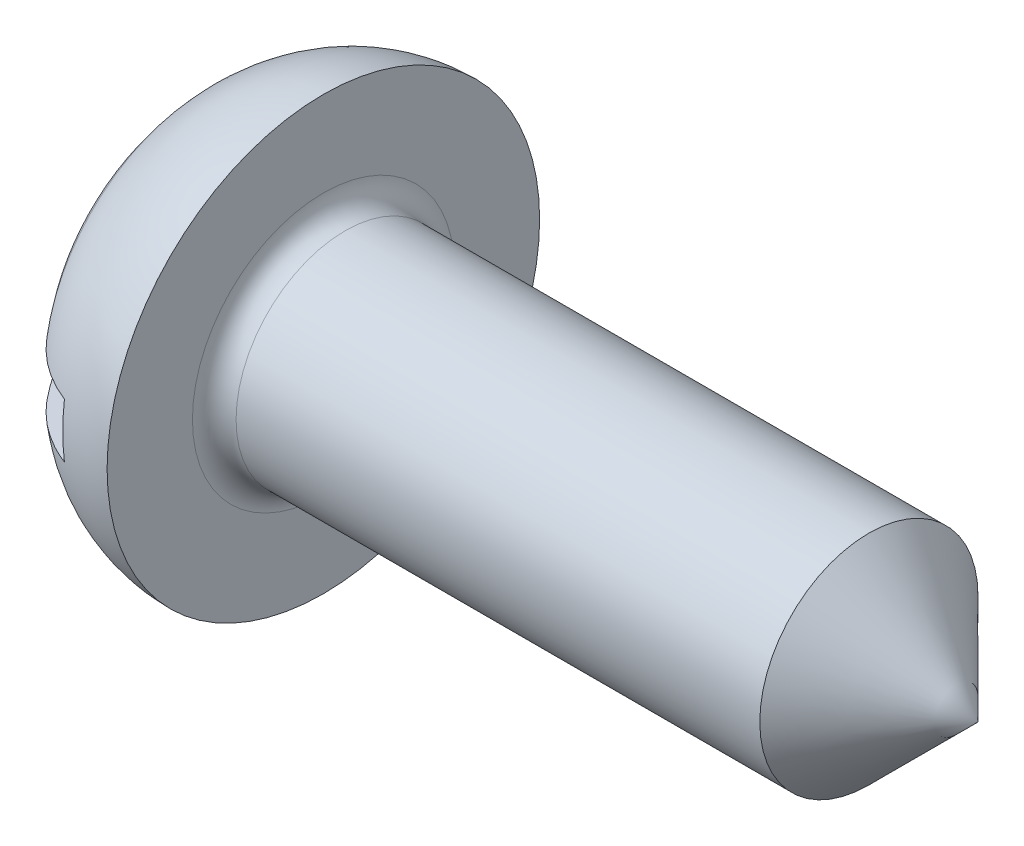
ISO-10303-21;
HEADER;
FILE_DESCRIPTION(('STEP AP214'),'2;1');
FILE_NAME('part.step','',(''),(''),'','','');
FILE_SCHEMA(('AUTOMOTIVE_DESIGN { 1 0 10303 214 1 1 1 1 }'));
ENDSEC;
DATA;
#1=APPLICATION_CONTEXT('core data for automotive mechanical design processes');
#2=APPLICATION_PROTOCOL_DEFINITION('international standard','automotive_design',2000,#1);
#3=PRODUCT_CONTEXT('',#1,'mechanical');
#4=PRODUCT('Part','Part','',(#3));
#5=PRODUCT_RELATED_PRODUCT_CATEGORY('part','',(#4));
#6=PRODUCT_DEFINITION_FORMATION('','',#4);
#7=PRODUCT_DEFINITION_CONTEXT('part definition',#1,'design');
#8=PRODUCT_DEFINITION('design','',#6,#7);
#9=PRODUCT_DEFINITION_SHAPE('','',#8);
#10=(LENGTH_UNIT() NAMED_UNIT(*) SI_UNIT(.MILLI.,.METRE.));
#11=(NAMED_UNIT(*) PLANE_ANGLE_UNIT() SI_UNIT($,.RADIAN.));
#12=(NAMED_UNIT(*) SI_UNIT($,.STERADIAN.) SOLID_ANGLE_UNIT());
#13=UNCERTAINTY_MEASURE_WITH_UNIT(LENGTH_MEASURE(1.E-05),#10,'distance_accuracy_value','');
#14=(GEOMETRIC_REPRESENTATION_CONTEXT(3) GLOBAL_UNCERTAINTY_ASSIGNED_CONTEXT((#13)) GLOBAL_UNIT_ASSIGNED_CONTEXT((#10,
#11,#12)) REPRESENTATION_CONTEXT('',''));
#15=CARTESIAN_POINT('',(0.,0.,0.));
#16=DIRECTION('',(0.,0.,1.));
#17=DIRECTION('',(1.,0.,0.));
#18=AXIS2_PLACEMENT_3D('',#15,#16,#17);
#19=CARTESIAN_POINT('',(7.59999999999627,0.,0.));
#20=DIRECTION('',(-1.,0.,0.));
#21=DIRECTION('',(0.,0.,1.));
#22=AXIS2_PLACEMENT_3D('',#19,#20,#21);
#23=CYLINDRICAL_SURFACE('',#22,1.);
#24=CARTESIAN_POINT('',(1.8,0.,0.));
#25=DIRECTION('',(1.,0.,0.));
#26=DIRECTION('',(0.,0.,-1.));
#27=AXIS2_PLACEMENT_3D('',#24,#25,#26);
#28=CIRCLE('',#27,1.);
#29=CARTESIAN_POINT('',(1.8,0.,-1.));
#30=VERTEX_POINT('',#29);
#31=EDGE_CURVE('E45',#30,#30,#28,.T.);
#32=ORIENTED_EDGE('',*,*,#31,.T.);
#33=EDGE_LOOP('',(#32));
#34=FACE_BOUND('',#33,.T.);
#35=CARTESIAN_POINT('',(6.59999999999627,0.,0.));
#36=DIRECTION('',(-1.,0.,0.));
#37=DIRECTION('',(0.,0.,1.));
#38=AXIS2_PLACEMENT_3D('',#35,#36,#37);
#39=CIRCLE('',#38,1.);
#40=CARTESIAN_POINT('',(6.59999999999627,0.,1.));
#41=VERTEX_POINT('',#40);
#42=EDGE_CURVE('E84',#41,#41,#39,.F.);
#43=ORIENTED_EDGE('',*,*,#42,.F.);
#44=EDGE_LOOP('',(#43));
#45=FACE_BOUND('',#44,.T.);
#46=ADVANCED_FACE('F37',(#34,#45),#23,.T.);
#47=CARTESIAN_POINT('',(2.28637267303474,0.,0.));
#48=DIRECTION('',(1.,0.,0.));
#49=DIRECTION('',(0.,0.,-1.));
#50=AXIS2_PLACEMENT_3D('',#47,#48,#49);
#51=SPHERICAL_SURFACE('',#50,2.3);
#52=CARTESIAN_POINT('',(2.28637267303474,-0.25,0.));
#53=DIRECTION('',(0.,-1.,0.));
#54=DIRECTION('',(0.,0.,-1.));
#55=AXIS2_PLACEMENT_3D('',#52,#53,#54);
#56=CIRCLE('',#55,2.28637267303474);
#57=CARTESIAN_POINT('',(0.532309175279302,-0.25,-1.4665473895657));
#58=VERTEX_POINT('',#57);
#59=CARTESIAN_POINT('',(0.532309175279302,-0.25,1.4665473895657));
#60=VERTEX_POINT('',#59);
#61=EDGE_CURVE('E56',#58,#60,#56,.F.);
#62=ORIENTED_EDGE('',*,*,#61,.F.);
#63=CARTESIAN_POINT('',(0.532309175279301,0.,0.));
#64=DIRECTION('',(1.,0.,0.));
#65=DIRECTION('',(0.,0.,-1.));
#66=AXIS2_PLACEMENT_3D('',#63,#64,#65);
#67=CIRCLE('',#66,1.48770334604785);
#68=EDGE_CURVE('E105',#60,#58,#67,.T.);
#69=ORIENTED_EDGE('',*,*,#68,.F.);
#70=EDGE_LOOP('',(#62,#69));
#71=FACE_BOUND('',#70,.T.);
#72=ADVANCED_FACE('F156',(#71),#51,.T.);
#73=CARTESIAN_POINT('',(1.6,0.,0.));
#74=DIRECTION('',(1.,0.,0.));
#75=DIRECTION('',(0.,0.,-1.));
#76=AXIS2_PLACEMENT_3D('',#73,#74,#75);
#77=PLANE('',#76);
#78=CARTESIAN_POINT('',(1.6,0.,0.));
#79=DIRECTION('',(1.,0.,0.));
#80=DIRECTION('',(0.,0.,-1.));
#81=AXIS2_PLACEMENT_3D('',#78,#79,#80);
#82=CIRCLE('',#81,1.2);
#83=CARTESIAN_POINT('',(1.6,0.,-1.2));
#84=VERTEX_POINT('',#83);
#85=EDGE_CURVE('E11',#84,#84,#82,.F.);
#86=ORIENTED_EDGE('',*,*,#85,.T.);
#87=EDGE_LOOP('',(#86));
#88=FACE_BOUND('',#87,.T.);
#89=CARTESIAN_POINT('',(1.6,0.,0.));
#90=DIRECTION('',(1.,0.,0.));
#91=DIRECTION('',(0.,0.,-1.));
#92=AXIS2_PLACEMENT_3D('',#89,#90,#91);
#93=CIRCLE('',#92,1.98214478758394);
#94=CARTESIAN_POINT('',(1.6,0.,-1.98214478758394));
#95=VERTEX_POINT('',#94);
#96=EDGE_CURVE('E92',#95,#95,#93,.T.);
#97=ORIENTED_EDGE('',*,*,#96,.T.);
#98=EDGE_LOOP('',(#97));
#99=FACE_BOUND('',#98,.T.);
#100=ADVANCED_FACE('F160',(#88,#99),#77,.T.);
#101=CARTESIAN_POINT('',(1.6,0.,0.));
#102=DIRECTION('',(1.,0.,0.));
#103=DIRECTION('',(0.,0.,-1.));
#104=AXIS2_PLACEMENT_3D('',#101,#102,#103);
#105=DEGENERATE_TOROIDAL_SURFACE('',#104,0.582144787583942,1.4,.T.);
#106=CARTESIAN_POINT('',(0.239970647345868,-0.25,0.));
#107=CARTESIAN_POINT('',(0.239968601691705,-0.25,0.0211338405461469));
#108=CARTESIAN_POINT('',(0.239295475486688,-0.25,0.0422684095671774));
#109=CARTESIAN_POINT('',(0.236831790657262,-0.25,0.0844859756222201));
#110=CARTESIAN_POINT('',(0.235040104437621,-0.25,0.105568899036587));
#111=CARTESIAN_POINT('',(0.230826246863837,-0.25,0.147819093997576));
#112=CARTESIAN_POINT('',(0.228399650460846,-0.25,0.168985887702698));
#113=CARTESIAN_POINT('',(0.223401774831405,-0.25,0.21130416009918));
#114=CARTESIAN_POINT('',(0.220830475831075,-0.25,0.232455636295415));
#115=CARTESIAN_POINT('',(0.215235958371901,-0.25,0.280490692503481));
#116=CARTESIAN_POINT('',(0.21227776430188,-0.25,0.307382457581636));
#117=CARTESIAN_POINT('',(0.207164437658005,-0.25,0.361239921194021));
#118=CARTESIAN_POINT('',(0.205009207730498,-0.25,0.388205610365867));
#119=CARTESIAN_POINT('',(0.200176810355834,-0.25,0.469191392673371));
#120=CARTESIAN_POINT('',(0.199128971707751,-0.25,0.523328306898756));
#121=CARTESIAN_POINT('',(0.20244165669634,-0.25,0.631104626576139));
#122=CARTESIAN_POINT('',(0.206766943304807,-0.25,0.68474497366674));
#123=CARTESIAN_POINT('',(0.221108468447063,-0.25,0.791269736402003));
#124=CARTESIAN_POINT('',(0.231126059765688,-0.25,0.844153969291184));
#125=CARTESIAN_POINT('',(0.263210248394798,-0.25,0.97375451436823));
#126=CARTESIAN_POINT('',(0.28875972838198,-0.25,1.04964203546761));
#127=CARTESIAN_POINT('',(0.352317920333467,-0.25,1.19628943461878));
#128=CARTESIAN_POINT('',(0.390367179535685,-0.25,1.26703169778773));
#129=CARTESIAN_POINT('',(0.47792833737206,-0.25,1.40102255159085));
#130=CARTESIAN_POINT('',(0.527438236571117,-0.25,1.46427244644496));
#131=CARTESIAN_POINT('',(0.636470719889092,-0.25,1.58131183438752));
#132=CARTESIAN_POINT('',(0.695980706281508,-0.25,1.6351130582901));
#133=CARTESIAN_POINT('',(0.822341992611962,-0.25,1.7309855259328));
#134=CARTESIAN_POINT('',(0.889065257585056,-0.25,1.77322560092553));
#135=CARTESIAN_POINT('',(1.02871257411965,-0.25,1.84584573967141));
#136=CARTESIAN_POINT('',(1.10163871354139,-0.25,1.87622179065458));
#137=CARTESIAN_POINT('',(1.25114051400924,-0.25,1.92406489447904));
#138=CARTESIAN_POINT('',(1.32769252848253,-0.25,1.94160587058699));
#139=CARTESIAN_POINT('',(1.48264591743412,-0.25,1.96355877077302));
#140=CARTESIAN_POINT('',(1.56104701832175,-0.25,1.96797262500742));
#141=CARTESIAN_POINT('',(1.71733151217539,-0.25,1.96355299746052));
#142=CARTESIAN_POINT('',(1.79521558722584,-0.25,1.95474358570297));
#143=CARTESIAN_POINT('',(1.9484095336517,-0.25,1.92417343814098));
#144=CARTESIAN_POINT('',(2.02371906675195,-0.25,1.90241100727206));
#145=CARTESIAN_POINT('',(2.16963316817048,-0.25,1.84655453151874));
#146=CARTESIAN_POINT('',(2.2402368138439,-0.25,1.8124580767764));
#147=CARTESIAN_POINT('',(2.37470479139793,-0.25,1.73293101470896));
#148=CARTESIAN_POINT('',(2.43857166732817,-0.25,1.68750470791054));
#149=CARTESIAN_POINT('',(2.55791000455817,-0.25,1.58653470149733));
#150=CARTESIAN_POINT('',(2.61336756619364,-0.25,1.53097457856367));
#151=CARTESIAN_POINT('',(2.71429272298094,-0.25,1.41131521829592));
#152=CARTESIAN_POINT('',(2.75974894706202,-0.25,1.3472063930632));
#153=CARTESIAN_POINT('',(2.83966738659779,-0.25,1.21188667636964));
#154=CARTESIAN_POINT('',(2.87405205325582,-0.25,1.14063008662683));
#155=CARTESIAN_POINT('',(2.93051409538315,-0.25,0.993605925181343));
#156=CARTESIAN_POINT('',(2.95262567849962,-0.25,0.917851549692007));
#157=CARTESIAN_POINT('',(2.9766574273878,-0.25,0.80163849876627));
#158=CARTESIAN_POINT('',(2.98316264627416,-0.25,0.762066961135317));
#159=CARTESIAN_POINT('',(2.99302677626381,-0.25,0.682518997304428));
#160=CARTESIAN_POINT('',(2.99638509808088,-0.25,0.642542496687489));
#161=CARTESIAN_POINT('',(3.00010192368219,-0.25,0.562336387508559));
#162=CARTESIAN_POINT('',(3.00045123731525,-0.25,0.522106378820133));
#163=CARTESIAN_POINT('',(2.99844884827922,-0.25,0.441736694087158));
#164=CARTESIAN_POINT('',(2.99609808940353,-0.25,0.401596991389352));
#165=CARTESIAN_POINT('',(2.9895199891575,-0.25,0.323594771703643));
#166=CARTESIAN_POINT('',(2.98539682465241,-0.25,0.285722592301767));
#167=CARTESIAN_POINT('',(2.97874889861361,-0.25,0.228977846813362));
#168=CARTESIAN_POINT('',(2.97645590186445,-0.25,0.210074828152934));
#169=CARTESIAN_POINT('',(2.9719832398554,-0.25,0.172251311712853));
#170=CARTESIAN_POINT('',(2.96980359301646,-0.25,0.153330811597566));
#171=CARTESIAN_POINT('',(2.96588657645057,-0.25,0.115382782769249));
#172=CARTESIAN_POINT('',(2.96415057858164,-0.25,0.0963551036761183));
#173=CARTESIAN_POINT('',(2.96150588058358,-0.25,0.0582433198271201));
#174=CARTESIAN_POINT('',(2.96059691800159,-0.25,0.0391592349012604));
#175=CARTESIAN_POINT('',(2.95985389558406,-0.25,0.000968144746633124));
#176=CARTESIAN_POINT('',(2.96001983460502,-0.25,-0.0181388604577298));
#177=CARTESIAN_POINT('',(2.96137949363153,-0.25,-0.0563196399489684));
#178=CARTESIAN_POINT('',(2.96257356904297,-0.25,-0.0753934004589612));
#179=CARTESIAN_POINT('',(2.96672742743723,-0.25,-0.126389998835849));
#180=CARTESIAN_POINT('',(2.97033548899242,-0.25,-0.158254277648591));
#181=CARTESIAN_POINT('',(2.97785247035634,-0.25,-0.221945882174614));
#182=CARTESIAN_POINT('',(2.98176147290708,-0.25,-0.253773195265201));
#183=CARTESIAN_POINT('',(2.98878169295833,-0.25,-0.31753910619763));
#184=CARTESIAN_POINT('',(2.99189257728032,-0.25,-0.349477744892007));
#185=CARTESIAN_POINT('',(2.99673435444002,-0.25,-0.413457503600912));
#186=CARTESIAN_POINT('',(2.99846538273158,-0.25,-0.445498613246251));
#187=CARTESIAN_POINT('',(3.00106303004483,-0.25,-0.541132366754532));
#188=CARTESIAN_POINT('',(2.99941352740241,-0.25,-0.604825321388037));
#189=CARTESIAN_POINT('',(2.9882410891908,-0.25,-0.731639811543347));
#190=CARTESIAN_POINT('',(2.97870734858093,-0.25,-0.794760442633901));
#191=CARTESIAN_POINT('',(2.95665053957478,-0.25,-0.895769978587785));
#192=CARTESIAN_POINT('',(2.94660368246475,-0.25,-0.934212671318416));
#193=CARTESIAN_POINT('',(2.92339202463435,-0.25,-1.01009692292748));
#194=CARTESIAN_POINT('',(2.91023044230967,-0.25,-1.04753947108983));
#195=CARTESIAN_POINT('',(2.86577841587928,-0.25,-1.15888233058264));
#196=CARTESIAN_POINT('',(2.82970539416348,-0.25,-1.23094320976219));
#197=CARTESIAN_POINT('',(2.74593402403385,-0.25,-1.36768572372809));
#198=CARTESIAN_POINT('',(2.69826252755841,-0.25,-1.43238390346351));
#199=CARTESIAN_POINT('',(2.59280794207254,-0.25,-1.55241876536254));
#200=CARTESIAN_POINT('',(2.53507299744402,-0.25,-1.60779765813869));
#201=CARTESIAN_POINT('',(2.41177739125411,-0.25,-1.70726477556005));
#202=CARTESIAN_POINT('',(2.34632329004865,-0.25,-1.7514851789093));
#203=CARTESIAN_POINT('',(2.20878188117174,-0.25,-1.82829757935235));
#204=CARTESIAN_POINT('',(2.13668480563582,-0.25,-1.86087209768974));
#205=CARTESIAN_POINT('',(1.98852312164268,-0.25,-1.91316459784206));
#206=CARTESIAN_POINT('',(1.91248879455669,-0.25,-1.93296841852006));
#207=CARTESIAN_POINT('',(1.75820609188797,-0.25,-1.95949250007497));
#208=CARTESIAN_POINT('',(1.67995874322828,-0.25,-1.96621873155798));
#209=CARTESIAN_POINT('',(1.52359412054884,-0.25,-1.96641066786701));
#210=CARTESIAN_POINT('',(1.44547687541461,-0.25,-1.95990102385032));
#211=CARTESIAN_POINT('',(1.29143706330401,-0.25,-1.93385722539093));
#212=CARTESIAN_POINT('',(1.21551470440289,-0.25,-1.91432184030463));
#213=CARTESIAN_POINT('',(1.06803517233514,-0.25,-1.8627912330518));
#214=CARTESIAN_POINT('',(0.996477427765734,-0.25,-1.83079764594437));
#215=CARTESIAN_POINT('',(0.85973558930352,-0.25,-1.75527090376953));
#216=CARTESIAN_POINT('',(0.794551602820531,-0.25,-1.71173755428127));
#217=CARTESIAN_POINT('',(0.672272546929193,-0.25,-1.61429345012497));
#218=CARTESIAN_POINT('',(0.61519246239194,-0.25,-1.56036389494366));
#219=CARTESIAN_POINT('',(0.510844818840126,-0.25,-1.44373773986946));
#220=CARTESIAN_POINT('',(0.463576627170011,-0.25,-1.38104170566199));
#221=CARTESIAN_POINT('',(0.379873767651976,-0.25,-1.24830501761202));
#222=CARTESIAN_POINT('',(0.343500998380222,-0.25,-1.17822534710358));
#223=CARTESIAN_POINT('',(0.282824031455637,-0.25,-1.03305378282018));
#224=CARTESIAN_POINT('',(0.258518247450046,-0.25,-0.957962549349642));
#225=CARTESIAN_POINT('',(0.222032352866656,-0.25,-0.80351881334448));
#226=CARTESIAN_POINT('',(0.210067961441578,-0.25,-0.724115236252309));
#227=CARTESIAN_POINT('',(0.201336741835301,-0.25,-0.604408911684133));
#228=CARTESIAN_POINT('',(0.199964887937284,-0.25,-0.564373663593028));
#229=CARTESIAN_POINT('',(0.200036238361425,-0.25,-0.48430549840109));
#230=CARTESIAN_POINT('',(0.201479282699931,-0.25,-0.444272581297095));
#231=CARTESIAN_POINT('',(0.206282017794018,-0.25,-0.370430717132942));
#232=CARTESIAN_POINT('',(0.209317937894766,-0.25,-0.336598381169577));
#233=CARTESIAN_POINT('',(0.21644273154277,-0.25,-0.269019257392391));
#234=CARTESIAN_POINT('',(0.220532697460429,-0.25,-0.235272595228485));
#235=CARTESIAN_POINT('',(0.228540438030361,-0.25,-0.168010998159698));
#236=CARTESIAN_POINT('',(0.232459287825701,-0.25,-0.13449625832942));
#237=CARTESIAN_POINT('',(0.236771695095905,-0.25,-0.0841070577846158));
#238=CARTESIAN_POINT('',(0.23794782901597,-0.25,-0.0673063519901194));
#239=CARTESIAN_POINT('',(0.239548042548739,-0.25,-0.0336705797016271));
#240=CARTESIAN_POINT('',(0.239972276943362,-0.25,-0.0168355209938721));
#241=CARTESIAN_POINT('',(0.239970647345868,-0.25,0.));
#242=B_SPLINE_CURVE_WITH_KNOTS('',3,(#106,#107,#108,#109,#110,#111,#112,#113,#114,#115,#116,
#117,#118,#119,#120,#121,#122,#123,#124,#125,#126,#127,#128,#129,#130,#131,#132,#133,#134,#135,
#136,#137,#138,#139,#140,#141,#142,#143,#144,#145,#146,#147,#148,#149,#150,#151,#152,#153,#154,
#155,#156,#157,#158,#159,#160,#161,#162,#163,#164,#165,#166,#167,#168,#169,#170,#171,#172,#173,
#174,#175,#176,#177,#178,#179,#180,#181,#182,#183,#184,#185,#186,#187,#188,#189,#190,#191,#192,
#193,#194,#195,#196,#197,#198,#199,#200,#201,#202,#203,#204,#205,#206,#207,#208,#209,#210,#211,
#212,#213,#214,#215,#216,#217,#218,#219,#220,#221,#222,#223,#224,#225,#226,#227,#228,#229,#230,
#231,#232,#233,#234,#235,#236,#237,#238,#239,#240,#241),.UNSPECIFIED.,.T.,.F.,(4,2,2,2,2,2,2,2,
2,2,2,2,2,2,2,2,2,2,2,2,2,2,2,2,2,2,2,2,2,2,2,2,2,2,2,2,2,2,2,2,2,2,2,2,2,2,2,2,2,2,2,2,2,2,2,2,
2,2,2,2,2,2,2,2,2,2,2,4),(0.,0.0633952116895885,0.126854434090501,0.190768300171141,
0.254690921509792,0.335844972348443,0.416989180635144,0.579192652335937,0.740337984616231,
0.901521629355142,1.14057102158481,1.38040363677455,1.62019444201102,1.85968540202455,
2.09546562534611,2.3313255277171,2.5658160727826,2.80027213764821,3.03430194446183,
3.26836238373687,3.50246857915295,3.73648604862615,3.97088620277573,4.20555149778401,
4.44182640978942,4.67743942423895,4.79764197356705,4.9178670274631,5.03845914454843,
5.15900912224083,5.27327696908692,5.33040296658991,5.38753821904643,5.44484806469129,
5.50213971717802,5.55943130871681,5.61674271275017,5.71292151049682,5.80912684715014,
5.90537228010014,6.00160826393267,6.19230282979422,6.38325916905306,6.5023335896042,
6.62128550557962,6.86177992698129,7.10172278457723,7.34054775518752,7.57639468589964,
7.81259411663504,8.04718890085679,8.28167655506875,8.51572788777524,8.74980133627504,
8.98384407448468,9.21789075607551,9.45236472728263,9.6868235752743,9.92259020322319,
10.1583258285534,10.398115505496,10.5182068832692,10.6382914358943,10.7401690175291,
10.8421526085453,10.9433585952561,10.9938705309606,11.0443720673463),.UNSPECIFIED.);
#243=CARTESIAN_POINT('',(1.1,-0.25,-1.87320547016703));
#244=VERTEX_POINT('',#243);
#245=EDGE_CURVE('E52',#244,#58,#242,.T.);
#246=ORIENTED_EDGE('',*,*,#245,.F.);
#247=CARTESIAN_POINT('',(1.1,0.,0.));
#248=DIRECTION('',(1.,0.,0.));
#249=DIRECTION('',(0.,0.,-1.));
#250=AXIS2_PLACEMENT_3D('',#247,#248,#249);
#251=CIRCLE('',#250,1.88981447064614);
#252=CARTESIAN_POINT('',(1.1,0.25,-1.873205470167));
#253=VERTEX_POINT('',#252);
#254=EDGE_CURVE('E113',#253,#244,#251,.F.);
#255=ORIENTED_EDGE('',*,*,#254,.F.);
#256=CARTESIAN_POINT('',(0.239970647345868,0.25,0.));
#257=CARTESIAN_POINT('',(0.239968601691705,0.25,-0.0211338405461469));
#258=CARTESIAN_POINT('',(0.239295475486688,0.25,-0.0422684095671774));
#259=CARTESIAN_POINT('',(0.236831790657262,0.25,-0.0844859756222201));
#260=CARTESIAN_POINT('',(0.235040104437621,0.25,-0.105568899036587));
#261=CARTESIAN_POINT('',(0.230826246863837,0.25,-0.147819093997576));
#262=CARTESIAN_POINT('',(0.228399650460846,0.25,-0.168985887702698));
#263=CARTESIAN_POINT('',(0.223401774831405,0.25,-0.21130416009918));
#264=CARTESIAN_POINT('',(0.220830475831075,0.25,-0.232455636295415));
#265=CARTESIAN_POINT('',(0.215235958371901,0.25,-0.280490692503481));
#266=CARTESIAN_POINT('',(0.21227776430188,0.25,-0.307382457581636));
#267=CARTESIAN_POINT('',(0.207164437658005,0.25,-0.361239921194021));
#268=CARTESIAN_POINT('',(0.205009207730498,0.25,-0.388205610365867));
#269=CARTESIAN_POINT('',(0.200176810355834,0.25,-0.469191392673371));
#270=CARTESIAN_POINT('',(0.199128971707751,0.25,-0.523328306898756));
#271=CARTESIAN_POINT('',(0.20244165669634,0.25,-0.631104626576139));
#272=CARTESIAN_POINT('',(0.206766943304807,0.25,-0.68474497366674));
#273=CARTESIAN_POINT('',(0.221108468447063,0.25,-0.791269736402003));
#274=CARTESIAN_POINT('',(0.231126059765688,0.25,-0.844153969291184));
#275=CARTESIAN_POINT('',(0.263210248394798,0.25,-0.97375451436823));
#276=CARTESIAN_POINT('',(0.28875972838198,0.25,-1.04964203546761));
#277=CARTESIAN_POINT('',(0.352317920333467,0.25,-1.19628943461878));
#278=CARTESIAN_POINT('',(0.390367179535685,0.25,-1.26703169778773));
#279=CARTESIAN_POINT('',(0.47792833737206,0.25,-1.40102255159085));
#280=CARTESIAN_POINT('',(0.527438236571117,0.25,-1.46427244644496));
#281=CARTESIAN_POINT('',(0.636470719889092,0.25,-1.58131183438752));
#282=CARTESIAN_POINT('',(0.695980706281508,0.25,-1.6351130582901));
#283=CARTESIAN_POINT('',(0.822341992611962,0.25,-1.7309855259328));
#284=CARTESIAN_POINT('',(0.889065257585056,0.25,-1.77322560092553));
#285=CARTESIAN_POINT('',(1.02871257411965,0.25,-1.84584573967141));
#286=CARTESIAN_POINT('',(1.10163871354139,0.25,-1.87622179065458));
#287=CARTESIAN_POINT('',(1.25114051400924,0.25,-1.92406489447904));
#288=CARTESIAN_POINT('',(1.32769252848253,0.25,-1.94160587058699));
#289=CARTESIAN_POINT('',(1.48264591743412,0.25,-1.96355877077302));
#290=CARTESIAN_POINT('',(1.56104701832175,0.25,-1.96797262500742));
#291=CARTESIAN_POINT('',(1.71733151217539,0.25,-1.96355299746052));
#292=CARTESIAN_POINT('',(1.79521558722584,0.25,-1.95474358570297));
#293=CARTESIAN_POINT('',(1.9484095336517,0.25,-1.92417343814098));
#294=CARTESIAN_POINT('',(2.02371906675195,0.25,-1.90241100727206));
#295=CARTESIAN_POINT('',(2.16963316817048,0.25,-1.84655453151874));
#296=CARTESIAN_POINT('',(2.2402368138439,0.25,-1.8124580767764));
#297=CARTESIAN_POINT('',(2.37470479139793,0.25,-1.73293101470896));
#298=CARTESIAN_POINT('',(2.43857166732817,0.25,-1.68750470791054));
#299=CARTESIAN_POINT('',(2.55791000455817,0.25,-1.58653470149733));
#300=CARTESIAN_POINT('',(2.61336756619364,0.25,-1.53097457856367));
#301=CARTESIAN_POINT('',(2.71429272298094,0.25,-1.41131521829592));
#302=CARTESIAN_POINT('',(2.75974894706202,0.25,-1.3472063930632));
#303=CARTESIAN_POINT('',(2.83966738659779,0.25,-1.21188667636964));
#304=CARTESIAN_POINT('',(2.87405205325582,0.25,-1.14063008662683));
#305=CARTESIAN_POINT('',(2.93051409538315,0.25,-0.993605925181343));
#306=CARTESIAN_POINT('',(2.95262567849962,0.25,-0.917851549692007));
#307=CARTESIAN_POINT('',(2.9766574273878,0.25,-0.80163849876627));
#308=CARTESIAN_POINT('',(2.98316264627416,0.25,-0.762066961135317));
#309=CARTESIAN_POINT('',(2.99302677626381,0.25,-0.682518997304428));
#310=CARTESIAN_POINT('',(2.99638509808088,0.25,-0.642542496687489));
#311=CARTESIAN_POINT('',(3.00010192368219,0.25,-0.562336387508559));
#312=CARTESIAN_POINT('',(3.00045123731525,0.25,-0.522106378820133));
#313=CARTESIAN_POINT('',(2.99844884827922,0.25,-0.441736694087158));
#314=CARTESIAN_POINT('',(2.99609808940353,0.25,-0.401596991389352));
#315=CARTESIAN_POINT('',(2.9895199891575,0.25,-0.323594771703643));
#316=CARTESIAN_POINT('',(2.98539682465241,0.25,-0.285722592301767));
#317=CARTESIAN_POINT('',(2.97874889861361,0.25,-0.228977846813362));
#318=CARTESIAN_POINT('',(2.97645590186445,0.25,-0.210074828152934));
#319=CARTESIAN_POINT('',(2.9719832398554,0.25,-0.172251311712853));
#320=CARTESIAN_POINT('',(2.96980359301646,0.25,-0.153330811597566));
#321=CARTESIAN_POINT('',(2.96588657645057,0.25,-0.115382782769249));
#322=CARTESIAN_POINT('',(2.96415057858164,0.25,-0.0963551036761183));
#323=CARTESIAN_POINT('',(2.96150588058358,0.25,-0.0582433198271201));
#324=CARTESIAN_POINT('',(2.96059691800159,0.25,-0.0391592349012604));
#325=CARTESIAN_POINT('',(2.95985389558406,0.25,-0.000968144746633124));
#326=CARTESIAN_POINT('',(2.96001983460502,0.25,0.0181388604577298));
#327=CARTESIAN_POINT('',(2.96137949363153,0.25,0.0563196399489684));
#328=CARTESIAN_POINT('',(2.96257356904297,0.25,0.0753934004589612));
#329=CARTESIAN_POINT('',(2.96672742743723,0.25,0.126389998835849));
#330=CARTESIAN_POINT('',(2.97033548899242,0.25,0.158254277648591));
#331=CARTESIAN_POINT('',(2.97785247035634,0.25,0.221945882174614));
#332=CARTESIAN_POINT('',(2.98176147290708,0.25,0.253773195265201));
#333=CARTESIAN_POINT('',(2.98878169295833,0.25,0.31753910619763));
#334=CARTESIAN_POINT('',(2.99189257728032,0.25,0.349477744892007));
#335=CARTESIAN_POINT('',(2.99673435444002,0.25,0.413457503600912));
#336=CARTESIAN_POINT('',(2.99846538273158,0.25,0.445498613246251));
#337=CARTESIAN_POINT('',(3.00106303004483,0.25,0.541132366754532));
#338=CARTESIAN_POINT('',(2.99941352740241,0.25,0.604825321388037));
#339=CARTESIAN_POINT('',(2.9882410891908,0.25,0.731639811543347));
#340=CARTESIAN_POINT('',(2.97870734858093,0.25,0.794760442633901));
#341=CARTESIAN_POINT('',(2.95665053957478,0.25,0.895769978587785));
#342=CARTESIAN_POINT('',(2.94660368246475,0.25,0.934212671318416));
#343=CARTESIAN_POINT('',(2.92339202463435,0.25,1.01009692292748));
#344=CARTESIAN_POINT('',(2.91023044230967,0.25,1.04753947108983));
#345=CARTESIAN_POINT('',(2.86577841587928,0.25,1.15888233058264));
#346=CARTESIAN_POINT('',(2.82970539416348,0.25,1.23094320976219));
#347=CARTESIAN_POINT('',(2.74593402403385,0.25,1.36768572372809));
#348=CARTESIAN_POINT('',(2.69826252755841,0.25,1.43238390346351));
#349=CARTESIAN_POINT('',(2.59280794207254,0.25,1.55241876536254));
#350=CARTESIAN_POINT('',(2.53507299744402,0.25,1.60779765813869));
#351=CARTESIAN_POINT('',(2.41177739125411,0.25,1.70726477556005));
#352=CARTESIAN_POINT('',(2.34632329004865,0.25,1.7514851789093));
#353=CARTESIAN_POINT('',(2.20878188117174,0.25,1.82829757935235));
#354=CARTESIAN_POINT('',(2.13668480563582,0.25,1.86087209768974));
#355=CARTESIAN_POINT('',(1.98852312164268,0.25,1.91316459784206));
#356=CARTESIAN_POINT('',(1.91248879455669,0.25,1.93296841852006));
#357=CARTESIAN_POINT('',(1.75820609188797,0.25,1.95949250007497));
#358=CARTESIAN_POINT('',(1.67995874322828,0.25,1.96621873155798));
#359=CARTESIAN_POINT('',(1.52359412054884,0.25,1.96641066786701));
#360=CARTESIAN_POINT('',(1.44547687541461,0.25,1.95990102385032));
#361=CARTESIAN_POINT('',(1.29143706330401,0.25,1.93385722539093));
#362=CARTESIAN_POINT('',(1.21551470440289,0.25,1.91432184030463));
#363=CARTESIAN_POINT('',(1.06803517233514,0.25,1.8627912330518));
#364=CARTESIAN_POINT('',(0.996477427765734,0.25,1.83079764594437));
#365=CARTESIAN_POINT('',(0.85973558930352,0.25,1.75527090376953));
#366=CARTESIAN_POINT('',(0.794551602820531,0.25,1.71173755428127));
#367=CARTESIAN_POINT('',(0.672272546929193,0.25,1.61429345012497));
#368=CARTESIAN_POINT('',(0.61519246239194,0.25,1.56036389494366));
#369=CARTESIAN_POINT('',(0.510844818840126,0.25,1.44373773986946));
#370=CARTESIAN_POINT('',(0.463576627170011,0.25,1.38104170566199));
#371=CARTESIAN_POINT('',(0.379873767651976,0.25,1.24830501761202));
#372=CARTESIAN_POINT('',(0.343500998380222,0.25,1.17822534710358));
#373=CARTESIAN_POINT('',(0.282824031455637,0.25,1.03305378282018));
#374=CARTESIAN_POINT('',(0.258518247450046,0.25,0.957962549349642));
#375=CARTESIAN_POINT('',(0.222032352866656,0.25,0.80351881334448));
#376=CARTESIAN_POINT('',(0.210067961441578,0.25,0.724115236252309));
#377=CARTESIAN_POINT('',(0.201336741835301,0.25,0.604408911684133));
#378=CARTESIAN_POINT('',(0.199964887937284,0.25,0.564373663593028));
#379=CARTESIAN_POINT('',(0.200036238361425,0.25,0.48430549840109));
#380=CARTESIAN_POINT('',(0.201479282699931,0.25,0.444272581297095));
#381=CARTESIAN_POINT('',(0.206282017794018,0.25,0.370430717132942));
#382=CARTESIAN_POINT('',(0.209317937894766,0.25,0.336598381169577));
#383=CARTESIAN_POINT('',(0.21644273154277,0.25,0.269019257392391));
#384=CARTESIAN_POINT('',(0.220532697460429,0.25,0.235272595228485));
#385=CARTESIAN_POINT('',(0.228540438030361,0.25,0.168010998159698));
#386=CARTESIAN_POINT('',(0.232459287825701,0.25,0.13449625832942));
#387=CARTESIAN_POINT('',(0.236771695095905,0.25,0.0841070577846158));
#388=CARTESIAN_POINT('',(0.23794782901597,0.25,0.0673063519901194));
#389=CARTESIAN_POINT('',(0.239548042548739,0.25,0.0336705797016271));
#390=CARTESIAN_POINT('',(0.239972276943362,0.25,0.0168355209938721));
#391=CARTESIAN_POINT('',(0.239970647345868,0.25,0.));
#392=B_SPLINE_CURVE_WITH_KNOTS('',3,(#256,#257,#258,#259,#260,#261,#262,#263,#264,#265,#266,
#267,#268,#269,#270,#271,#272,#273,#274,#275,#276,#277,#278,#279,#280,#281,#282,#283,#284,#285,
#286,#287,#288,#289,#290,#291,#292,#293,#294,#295,#296,#297,#298,#299,#300,#301,#302,#303,#304,
#305,#306,#307,#308,#309,#310,#311,#312,#313,#314,#315,#316,#317,#318,#319,#320,#321,#322,#323,
#324,#325,#326,#327,#328,#329,#330,#331,#332,#333,#334,#335,#336,#337,#338,#339,#340,#341,#342,
#343,#344,#345,#346,#347,#348,#349,#350,#351,#352,#353,#354,#355,#356,#357,#358,#359,#360,#361,
#362,#363,#364,#365,#366,#367,#368,#369,#370,#371,#372,#373,#374,#375,#376,#377,#378,#379,#380,
#381,#382,#383,#384,#385,#386,#387,#388,#389,#390,#391),.UNSPECIFIED.,.T.,.F.,(4,2,2,2,2,2,2,2,
2,2,2,2,2,2,2,2,2,2,2,2,2,2,2,2,2,2,2,2,2,2,2,2,2,2,2,2,2,2,2,2,2,2,2,2,2,2,2,2,2,2,2,2,2,2,2,2,
2,2,2,2,2,2,2,2,2,2,2,4),(0.,0.0633952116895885,0.126854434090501,0.190768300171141,
0.254690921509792,0.335844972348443,0.416989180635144,0.579192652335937,0.740337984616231,
0.901521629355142,1.14057102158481,1.38040363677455,1.62019444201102,1.85968540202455,
2.09546562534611,2.3313255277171,2.5658160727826,2.80027213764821,3.03430194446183,
3.26836238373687,3.50246857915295,3.73648604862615,3.97088620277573,4.20555149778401,
4.44182640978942,4.67743942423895,4.79764197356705,4.9178670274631,5.03845914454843,
5.15900912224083,5.27327696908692,5.33040296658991,5.38753821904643,5.44484806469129,
5.50213971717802,5.55943130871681,5.61674271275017,5.71292151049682,5.80912684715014,
5.90537228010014,6.00160826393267,6.19230282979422,6.38325916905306,6.5023335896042,
6.62128550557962,6.86177992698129,7.10172278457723,7.34054775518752,7.57639468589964,
7.81259411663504,8.04718890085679,8.28167655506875,8.51572788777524,8.74980133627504,
8.98384407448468,9.21789075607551,9.45236472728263,9.6868235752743,9.92259020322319,
10.1583258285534,10.398115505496,10.5182068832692,10.6382914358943,10.7401690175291,
10.8421526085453,10.9433585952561,10.9938705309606,11.0443720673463),.UNSPECIFIED.);
#393=CARTESIAN_POINT('',(0.532309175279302,0.25,-1.4665473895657));
#394=VERTEX_POINT('',#393);
#395=EDGE_CURVE('E139',#394,#253,#392,.T.);
#396=ORIENTED_EDGE('',*,*,#395,.F.);
#397=CARTESIAN_POINT('',(0.532309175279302,0.25,1.4665473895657));
#398=VERTEX_POINT('',#397);
#399=EDGE_CURVE('E99',#394,#398,#67,.T.);
#400=ORIENTED_EDGE('',*,*,#399,.T.);
#401=CARTESIAN_POINT('',(1.1,0.25,1.87320547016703));
#402=VERTEX_POINT('',#401);
#403=EDGE_CURVE('E123',#402,#398,#392,.T.);
#404=ORIENTED_EDGE('',*,*,#403,.F.);
#405=CARTESIAN_POINT('',(1.1,-0.25,1.873205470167));
#406=VERTEX_POINT('',#405);
#407=EDGE_CURVE('E111',#406,#402,#251,.F.);
#408=ORIENTED_EDGE('',*,*,#407,.F.);
#409=EDGE_CURVE('E116',#60,#406,#242,.T.);
#410=ORIENTED_EDGE('',*,*,#409,.F.);
#411=ORIENTED_EDGE('',*,*,#68,.T.);
#412=EDGE_LOOP('',(#246,#255,#396,#400,#404,#408,#410,#411));
#413=FACE_BOUND('',#412,.T.);
#414=ORIENTED_EDGE('',*,*,#96,.F.);
#415=EDGE_LOOP('',(#414));
#416=FACE_BOUND('',#415,.T.);
#417=ADVANCED_FACE('F125',(#413,#416),#105,.T.);
#418=CARTESIAN_POINT('',(2.28637267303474,0.25,0.));
#419=DIRECTION('',(0.,1.,0.));
#420=DIRECTION('',(0.,0.,1.));
#421=AXIS2_PLACEMENT_3D('',#418,#419,#420);
#422=CIRCLE('',#421,2.28637267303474);
#423=EDGE_CURVE('E145',#398,#394,#422,.F.);
#424=ORIENTED_EDGE('',*,*,#423,.F.);
#425=ORIENTED_EDGE('',*,*,#399,.F.);
#426=EDGE_LOOP('',(#424,#425));
#427=FACE_BOUND('',#426,.T.);
#428=ADVANCED_FACE('F133',(#427),#51,.T.);
#429=CARTESIAN_POINT('',(0.,-0.25,-1.98214478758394));
#430=DIRECTION('',(0.,-1.,0.));
#431=DIRECTION('',(0.,0.,-1.));
#432=AXIS2_PLACEMENT_3D('',#429,#430,#431);
#433=PLANE('',#432);
#434=ORIENTED_EDGE('',*,*,#409,.T.);
#435=DIRECTION('',(0.,0.,1.));
#436=VECTOR('',#435,1.);
#437=CARTESIAN_POINT('',(1.1,-0.25,-1.98214478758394));
#438=LINE('',#437,#436);
#439=EDGE_CURVE('E89',#244,#406,#438,.T.);
#440=ORIENTED_EDGE('',*,*,#439,.F.);
#441=ORIENTED_EDGE('',*,*,#245,.T.);
#442=ORIENTED_EDGE('',*,*,#61,.T.);
#443=EDGE_LOOP('',(#434,#440,#441,#442));
#444=FACE_BOUND('',#443,.T.);
#445=ADVANCED_FACE('F128',(#444),#433,.F.);
#446=CARTESIAN_POINT('',(1.1,0.25,-1.98214478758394));
#447=DIRECTION('',(0.,1.,0.));
#448=DIRECTION('',(0.,0.,1.));
#449=AXIS2_PLACEMENT_3D('',#446,#447,#448);
#450=PLANE('',#449);
#451=ORIENTED_EDGE('',*,*,#395,.T.);
#452=DIRECTION('',(0.,0.,1.));
#453=VECTOR('',#452,1.);
#454=CARTESIAN_POINT('',(1.1,0.25,-1.98214478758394));
#455=LINE('',#454,#453);
#456=EDGE_CURVE('E86',#253,#402,#455,.T.);
#457=ORIENTED_EDGE('',*,*,#456,.T.);
#458=ORIENTED_EDGE('',*,*,#403,.T.);
#459=ORIENTED_EDGE('',*,*,#423,.T.);
#460=EDGE_LOOP('',(#451,#457,#458,#459));
#461=FACE_BOUND('',#460,.T.);
#462=ADVANCED_FACE('F132',(#461),#450,.F.);
#463=CARTESIAN_POINT('',(1.1,0.,0.));
#464=DIRECTION('',(-1.,0.,0.));
#465=DIRECTION('',(0.,0.,1.));
#466=AXIS2_PLACEMENT_3D('',#463,#464,#465);
#467=PLANE('',#466);
#468=ORIENTED_EDGE('',*,*,#254,.T.);
#469=ORIENTED_EDGE('',*,*,#439,.T.);
#470=ORIENTED_EDGE('',*,*,#407,.T.);
#471=ORIENTED_EDGE('',*,*,#456,.F.);
#472=EDGE_LOOP('',(#468,#469,#470,#471));
#473=FACE_BOUND('',#472,.T.);
#474=ADVANCED_FACE('F80',(#473),#467,.T.);
#475=CARTESIAN_POINT('',(5.59999999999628,0.,0.));
#476=DIRECTION('',(-1.,0.,0.));
#477=DIRECTION('',(0.,0.,1.));
#478=AXIS2_PLACEMENT_3D('',#475,#476,#477);
#479=CONICAL_SURFACE('',#478,2.,0.78539816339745);
#480=CARTESIAN_POINT('',(7.59999999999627,0.,0.));
#481=VERTEX_POINT('',#480);
#482=VERTEX_LOOP('',#481);
#483=FACE_BOUND('',#482,.T.);
#484=ORIENTED_EDGE('',*,*,#42,.T.);
#485=EDGE_LOOP('',(#484));
#486=FACE_BOUND('',#485,.T.);
#487=ADVANCED_FACE('F77',(#483,#486),#479,.T.);
#488=CARTESIAN_POINT('',(1.8,0.,0.));
#489=DIRECTION('',(1.,0.,0.));
#490=DIRECTION('',(0.,0.,-1.));
#491=AXIS2_PLACEMENT_3D('',#488,#489,#490);
#492=TOROIDAL_SURFACE('',#491,1.2,0.2);
#493=ORIENTED_EDGE('',*,*,#85,.F.);
#494=EDGE_LOOP('',(#493));
#495=FACE_BOUND('',#494,.T.);
#496=ORIENTED_EDGE('',*,*,#31,.F.);
#497=EDGE_LOOP('',(#496));
#498=FACE_BOUND('',#497,.T.);
#499=ADVANCED_FACE('F39',(#495,#498),#492,.F.);
#500=CLOSED_SHELL('',(#46,#72,#100,#417,#428,#445,#462,#474,#487,#499));
#501=MANIFOLD_SOLID_BREP('B2',#500);
#502=ADVANCED_BREP_SHAPE_REPRESENTATION('',(#18,#501),#14);
#503=SHAPE_DEFINITION_REPRESENTATION(#9,#502);
ENDSEC;
END-ISO-10303-21;
